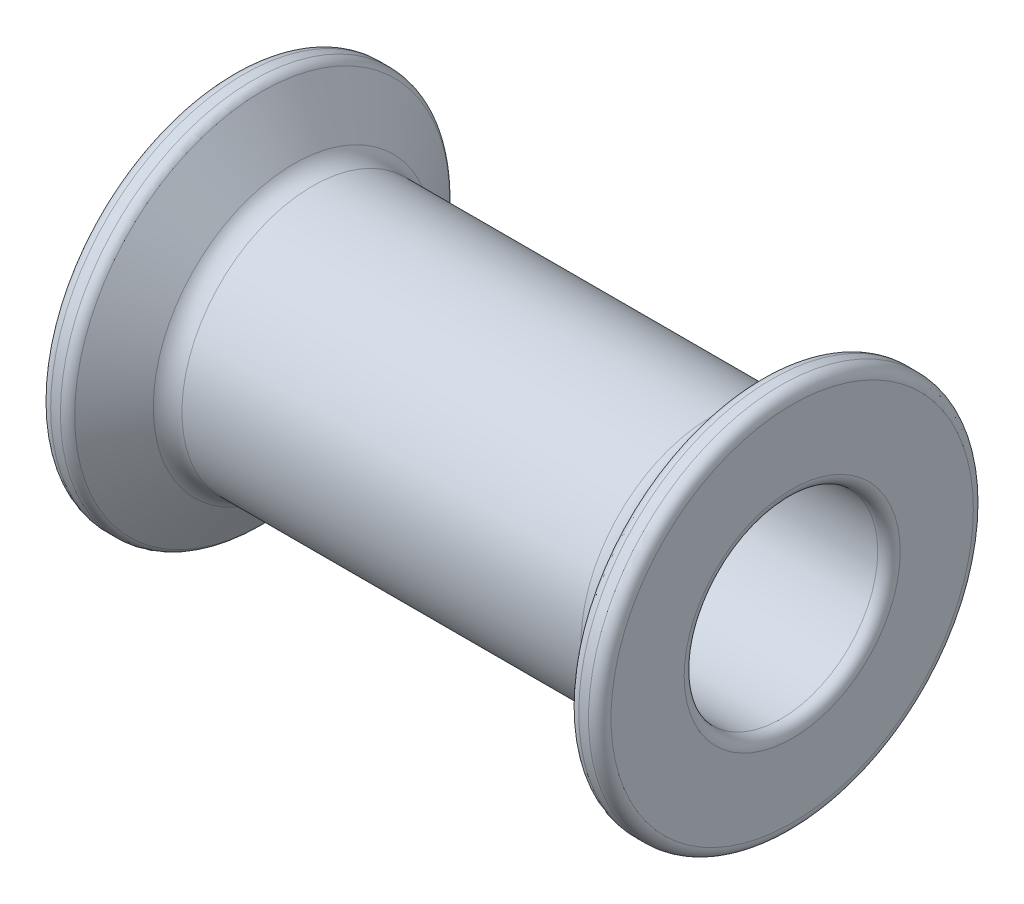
ISO-10303-21;
HEADER;
FILE_DESCRIPTION(('STEP AP214'),'2;1');
FILE_NAME('part.step','',(''),(''),'','','');
FILE_SCHEMA(('AUTOMOTIVE_DESIGN { 1 0 10303 214 1 1 1 1 }'));
ENDSEC;
DATA;
#1=APPLICATION_CONTEXT('core data for automotive mechanical design processes');
#2=APPLICATION_PROTOCOL_DEFINITION('international standard','automotive_design',2000,#1);
#3=PRODUCT_CONTEXT('',#1,'mechanical');
#4=PRODUCT('Part','Part','',(#3));
#5=PRODUCT_RELATED_PRODUCT_CATEGORY('part','',(#4));
#6=PRODUCT_DEFINITION_FORMATION('','',#4);
#7=PRODUCT_DEFINITION_CONTEXT('part definition',#1,'design');
#8=PRODUCT_DEFINITION('design','',#6,#7);
#9=PRODUCT_DEFINITION_SHAPE('','',#8);
#10=(LENGTH_UNIT() NAMED_UNIT(*) SI_UNIT(.MILLI.,.METRE.));
#11=(NAMED_UNIT(*) PLANE_ANGLE_UNIT() SI_UNIT($,.RADIAN.));
#12=(NAMED_UNIT(*) SI_UNIT($,.STERADIAN.) SOLID_ANGLE_UNIT());
#13=UNCERTAINTY_MEASURE_WITH_UNIT(LENGTH_MEASURE(1.E-05),#10,'distance_accuracy_value','');
#14=(GEOMETRIC_REPRESENTATION_CONTEXT(3) GLOBAL_UNCERTAINTY_ASSIGNED_CONTEXT((#13)) GLOBAL_UNIT_ASSIGNED_CONTEXT((#10,
#11,#12)) REPRESENTATION_CONTEXT('',''));
#15=CARTESIAN_POINT('',(0.,0.,0.));
#16=DIRECTION('',(0.,0.,1.));
#17=DIRECTION('',(1.,0.,0.));
#18=AXIS2_PLACEMENT_3D('',#15,#16,#17);
#19=CARTESIAN_POINT('',(0.,0.,0.));
#20=DIRECTION('',(1.,0.,0.));
#21=DIRECTION('',(0.,0.,-1.));
#22=AXIS2_PLACEMENT_3D('',#19,#20,#21);
#23=CYLINDRICAL_SURFACE('',#22,5.8);
#24=CARTESIAN_POINT('',(-8.86750447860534,0.,0.));
#25=DIRECTION('',(1.,0.,0.));
#26=DIRECTION('',(0.,0.,-1.));
#27=AXIS2_PLACEMENT_3D('',#24,#25,#26);
#28=CIRCLE('',#27,5.8);
#29=CARTESIAN_POINT('',(-8.86750447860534,0.,-5.8));
#30=VERTEX_POINT('',#29);
#31=EDGE_CURVE('E81',#30,#30,#28,.T.);
#32=ORIENTED_EDGE('',*,*,#31,.T.);
#33=EDGE_LOOP('',(#32));
#34=FACE_BOUND('',#33,.T.);
#35=CARTESIAN_POINT('',(8.86750447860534,0.,0.));
#36=DIRECTION('',(1.,0.,0.));
#37=DIRECTION('',(0.,0.,-1.));
#38=AXIS2_PLACEMENT_3D('',#35,#36,#37);
#39=CIRCLE('',#38,5.8);
#40=CARTESIAN_POINT('',(8.86750447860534,0.,-5.8));
#41=VERTEX_POINT('',#40);
#42=EDGE_CURVE('E84',#41,#41,#39,.F.);
#43=ORIENTED_EDGE('',*,*,#42,.T.);
#44=EDGE_LOOP('',(#43));
#45=FACE_BOUND('',#44,.T.);
#46=ADVANCED_FACE('F31',(#34,#45),#23,.T.);
#47=CARTESIAN_POINT('',(-9.4,0.,0.));
#48=DIRECTION('',(-1.,0.,0.));
#49=DIRECTION('',(0.,0.,1.));
#50=AXIS2_PLACEMENT_3D('',#47,#48,#49);
#51=CONICAL_SURFACE('',#50,5.8,0.978609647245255);
#52=CARTESIAN_POINT('',(-11.1013867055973,0.,0.));
#53=DIRECTION('',(1.,0.,0.));
#54=DIRECTION('',(0.,0.,-1.));
#55=AXIS2_PLACEMENT_3D('',#52,#53,#54);
#56=CIRCLE('',#55,8.32908834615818);
#57=CARTESIAN_POINT('',(-11.1013867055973,0.,-8.32908834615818));
#58=VERTEX_POINT('',#57);
#59=EDGE_CURVE('E42',#58,#58,#56,.T.);
#60=ORIENTED_EDGE('',*,*,#59,.T.);
#61=EDGE_LOOP('',(#60));
#62=FACE_BOUND('',#61,.T.);
#63=CARTESIAN_POINT('',(-9.69722658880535,0.,0.));
#64=DIRECTION('',(-1.,0.,0.));
#65=DIRECTION('',(0.,0.,1.));
#66=AXIS2_PLACEMENT_3D('',#63,#64,#65);
#67=CIRCLE('',#66,6.24182330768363);
#68=CARTESIAN_POINT('',(-9.69722658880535,0.,6.24182330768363));
#69=VERTEX_POINT('',#68);
#70=EDGE_CURVE('E78',#69,#69,#67,.T.);
#71=ORIENTED_EDGE('',*,*,#70,.T.);
#72=EDGE_LOOP('',(#71));
#73=FACE_BOUND('',#72,.T.);
#74=ADVANCED_FACE('F114',(#62,#73),#51,.T.);
#75=CARTESIAN_POINT('',(0.,0.,0.));
#76=DIRECTION('',(1.,0.,0.));
#77=DIRECTION('',(0.,0.,-1.));
#78=AXIS2_PLACEMENT_3D('',#75,#76,#77);
#79=CYLINDRICAL_SURFACE('',#78,8.55);
#80=CARTESIAN_POINT('',(-11.5162477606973,0.,0.));
#81=DIRECTION('',(-1.,0.,0.));
#82=DIRECTION('',(0.,0.,1.));
#83=AXIS2_PLACEMENT_3D('',#80,#81,#82);
#84=CIRCLE('',#83,8.55);
#85=CARTESIAN_POINT('',(-11.5162477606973,0.,8.55));
#86=VERTEX_POINT('',#85);
#87=EDGE_CURVE('E10',#86,#86,#84,.T.);
#88=ORIENTED_EDGE('',*,*,#87,.T.);
#89=EDGE_LOOP('',(#88));
#90=FACE_BOUND('',#89,.T.);
#91=CARTESIAN_POINT('',(-11.95,0.,0.));
#92=DIRECTION('',(-1.,0.,0.));
#93=DIRECTION('',(0.,0.,1.));
#94=AXIS2_PLACEMENT_3D('',#91,#92,#93);
#95=CIRCLE('',#94,8.55);
#96=CARTESIAN_POINT('',(-11.95,0.,8.55));
#97=VERTEX_POINT('',#96);
#98=EDGE_CURVE('E38',#97,#97,#95,.F.);
#99=ORIENTED_EDGE('',*,*,#98,.T.);
#100=EDGE_LOOP('',(#99));
#101=FACE_BOUND('',#100,.T.);
#102=ADVANCED_FACE('F120',(#90,#101),#79,.T.);
#103=CARTESIAN_POINT('',(-12.45,8.55,0.));
#104=DIRECTION('',(-1.,0.,0.));
#105=DIRECTION('',(0.,0.,1.));
#106=AXIS2_PLACEMENT_3D('',#103,#104,#105);
#107=PLANE('',#106);
#108=CARTESIAN_POINT('',(-12.45,0.,0.));
#109=DIRECTION('',(-1.,0.,0.));
#110=DIRECTION('',(0.,0.,1.));
#111=AXIS2_PLACEMENT_3D('',#108,#109,#110);
#112=CIRCLE('',#111,4.8);
#113=CARTESIAN_POINT('',(-12.45,0.,4.8));
#114=VERTEX_POINT('',#113);
#115=EDGE_CURVE('E69',#114,#114,#112,.F.);
#116=ORIENTED_EDGE('',*,*,#115,.T.);
#117=EDGE_LOOP('',(#116));
#118=FACE_BOUND('',#117,.T.);
#119=CARTESIAN_POINT('',(-12.45,0.,0.));
#120=DIRECTION('',(-1.,0.,0.));
#121=DIRECTION('',(0.,0.,1.));
#122=AXIS2_PLACEMENT_3D('',#119,#120,#121);
#123=CIRCLE('',#122,8.05);
#124=CARTESIAN_POINT('',(-12.45,0.,8.05));
#125=VERTEX_POINT('',#124);
#126=EDGE_CURVE('E72',#125,#125,#123,.T.);
#127=ORIENTED_EDGE('',*,*,#126,.T.);
#128=EDGE_LOOP('',(#127));
#129=FACE_BOUND('',#128,.T.);
#130=ADVANCED_FACE('F110',(#118,#129),#107,.T.);
#131=CARTESIAN_POINT('',(0.,0.,0.));
#132=DIRECTION('',(1.,0.,0.));
#133=DIRECTION('',(0.,0.,-1.));
#134=AXIS2_PLACEMENT_3D('',#131,#132,#133);
#135=CYLINDRICAL_SURFACE('',#134,4.3);
#136=CARTESIAN_POINT('',(-11.95,0.,0.));
#137=DIRECTION('',(-1.,0.,0.));
#138=DIRECTION('',(0.,0.,1.));
#139=AXIS2_PLACEMENT_3D('',#136,#137,#138);
#140=CIRCLE('',#139,4.3);
#141=CARTESIAN_POINT('',(-11.95,0.,4.3));
#142=VERTEX_POINT('',#141);
#143=EDGE_CURVE('E63',#142,#142,#140,.T.);
#144=ORIENTED_EDGE('',*,*,#143,.T.);
#145=EDGE_LOOP('',(#144));
#146=FACE_BOUND('',#145,.T.);
#147=CARTESIAN_POINT('',(11.95,0.,0.));
#148=DIRECTION('',(1.,0.,0.));
#149=DIRECTION('',(0.,0.,-1.));
#150=AXIS2_PLACEMENT_3D('',#147,#148,#149);
#151=CIRCLE('',#150,4.3);
#152=CARTESIAN_POINT('',(11.95,0.,-4.3));
#153=VERTEX_POINT('',#152);
#154=EDGE_CURVE('E66',#153,#153,#151,.T.);
#155=ORIENTED_EDGE('',*,*,#154,.T.);
#156=EDGE_LOOP('',(#155));
#157=FACE_BOUND('',#156,.T.);
#158=ADVANCED_FACE('F100',(#146,#157),#135,.F.);
#159=CARTESIAN_POINT('',(9.4,0.,0.));
#160=DIRECTION('',(1.,0.,0.));
#161=DIRECTION('',(0.,0.,1.));
#162=AXIS2_PLACEMENT_3D('',#159,#160,#161);
#163=CONICAL_SURFACE('',#162,5.8,0.978609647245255);
#164=CARTESIAN_POINT('',(11.1013867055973,0.,0.));
#165=DIRECTION('',(-1.,0.,0.));
#166=DIRECTION('',(0.,0.,1.));
#167=AXIS2_PLACEMENT_3D('',#164,#165,#166);
#168=CIRCLE('',#167,8.32908834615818);
#169=CARTESIAN_POINT('',(11.1013867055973,0.,8.32908834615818));
#170=VERTEX_POINT('',#169);
#171=EDGE_CURVE('E46',#170,#170,#168,.T.);
#172=ORIENTED_EDGE('',*,*,#171,.T.);
#173=EDGE_LOOP('',(#172));
#174=FACE_BOUND('',#173,.T.);
#175=CARTESIAN_POINT('',(9.69722658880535,0.,0.));
#176=DIRECTION('',(1.,0.,0.));
#177=DIRECTION('',(0.,0.,-1.));
#178=AXIS2_PLACEMENT_3D('',#175,#176,#177);
#179=CIRCLE('',#178,6.24182330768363);
#180=CARTESIAN_POINT('',(9.69722658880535,0.,-6.24182330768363));
#181=VERTEX_POINT('',#180);
#182=EDGE_CURVE('E75',#181,#181,#179,.T.);
#183=ORIENTED_EDGE('',*,*,#182,.T.);
#184=EDGE_LOOP('',(#183));
#185=FACE_BOUND('',#184,.T.);
#186=ADVANCED_FACE('F97',(#174,#185),#163,.T.);
#187=CARTESIAN_POINT('',(0.,0.,0.));
#188=DIRECTION('',(-1.,0.,0.));
#189=DIRECTION('',(0.,0.,-1.));
#190=AXIS2_PLACEMENT_3D('',#187,#188,#189);
#191=CYLINDRICAL_SURFACE('',#190,8.55);
#192=CARTESIAN_POINT('',(11.95,0.,0.));
#193=DIRECTION('',(1.,0.,0.));
#194=DIRECTION('',(0.,0.,-1.));
#195=AXIS2_PLACEMENT_3D('',#192,#193,#194);
#196=CIRCLE('',#195,8.55);
#197=CARTESIAN_POINT('',(11.95,0.,-8.55));
#198=VERTEX_POINT('',#197);
#199=EDGE_CURVE('E51',#198,#198,#196,.F.);
#200=ORIENTED_EDGE('',*,*,#199,.T.);
#201=EDGE_LOOP('',(#200));
#202=FACE_BOUND('',#201,.T.);
#203=CARTESIAN_POINT('',(11.5162477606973,0.,0.));
#204=DIRECTION('',(-1.,0.,0.));
#205=DIRECTION('',(0.,0.,1.));
#206=AXIS2_PLACEMENT_3D('',#203,#204,#205);
#207=CIRCLE('',#206,8.55);
#208=CARTESIAN_POINT('',(11.5162477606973,0.,8.55));
#209=VERTEX_POINT('',#208);
#210=EDGE_CURVE('E54',#209,#209,#207,.F.);
#211=ORIENTED_EDGE('',*,*,#210,.T.);
#212=EDGE_LOOP('',(#211));
#213=FACE_BOUND('',#212,.T.);
#214=ADVANCED_FACE('F99',(#202,#213),#191,.T.);
#215=CARTESIAN_POINT('',(12.45,8.55,0.));
#216=DIRECTION('',(1.,0.,0.));
#217=DIRECTION('',(0.,0.,1.));
#218=AXIS2_PLACEMENT_3D('',#215,#216,#217);
#219=PLANE('',#218);
#220=CARTESIAN_POINT('',(12.45,0.,0.));
#221=DIRECTION('',(1.,0.,0.));
#222=DIRECTION('',(0.,0.,-1.));
#223=AXIS2_PLACEMENT_3D('',#220,#221,#222);
#224=CIRCLE('',#223,4.8);
#225=CARTESIAN_POINT('',(12.45,0.,-4.8));
#226=VERTEX_POINT('',#225);
#227=EDGE_CURVE('E57',#226,#226,#224,.F.);
#228=ORIENTED_EDGE('',*,*,#227,.T.);
#229=EDGE_LOOP('',(#228));
#230=FACE_BOUND('',#229,.T.);
#231=CARTESIAN_POINT('',(12.45,0.,0.));
#232=DIRECTION('',(1.,0.,0.));
#233=DIRECTION('',(0.,0.,-1.));
#234=AXIS2_PLACEMENT_3D('',#231,#232,#233);
#235=CIRCLE('',#234,8.05);
#236=CARTESIAN_POINT('',(12.45,0.,-8.05));
#237=VERTEX_POINT('',#236);
#238=EDGE_CURVE('E60',#237,#237,#235,.T.);
#239=ORIENTED_EDGE('',*,*,#238,.T.);
#240=EDGE_LOOP('',(#239));
#241=FACE_BOUND('',#240,.T.);
#242=ADVANCED_FACE('F107',(#230,#241),#219,.T.);
#243=CARTESIAN_POINT('',(-8.86750447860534,0.,0.));
#244=DIRECTION('',(1.,0.,0.));
#245=DIRECTION('',(0.,0.,-1.));
#246=AXIS2_PLACEMENT_3D('',#243,#244,#245);
#247=TOROIDAL_SURFACE('',#246,6.8,1.);
#248=ORIENTED_EDGE('',*,*,#70,.F.);
#249=EDGE_LOOP('',(#248));
#250=FACE_BOUND('',#249,.T.);
#251=ORIENTED_EDGE('',*,*,#31,.F.);
#252=EDGE_LOOP('',(#251));
#253=FACE_BOUND('',#252,.T.);
#254=ADVANCED_FACE('F93',(#250,#253),#247,.F.);
#255=CARTESIAN_POINT('',(8.86750447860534,0.,0.));
#256=DIRECTION('',(1.,0.,0.));
#257=DIRECTION('',(0.,0.,-1.));
#258=AXIS2_PLACEMENT_3D('',#255,#256,#257);
#259=TOROIDAL_SURFACE('',#258,6.8,1.);
#260=ORIENTED_EDGE('',*,*,#42,.F.);
#261=EDGE_LOOP('',(#260));
#262=FACE_BOUND('',#261,.T.);
#263=ORIENTED_EDGE('',*,*,#182,.F.);
#264=EDGE_LOOP('',(#263));
#265=FACE_BOUND('',#264,.T.);
#266=ADVANCED_FACE('F89',(#262,#265),#259,.F.);
#267=CARTESIAN_POINT('',(-11.95,0.,0.));
#268=DIRECTION('',(-1.,0.,0.));
#269=DIRECTION('',(0.,0.,1.));
#270=AXIS2_PLACEMENT_3D('',#267,#268,#269);
#271=TOROIDAL_SURFACE('',#270,4.8,0.5);
#272=ORIENTED_EDGE('',*,*,#143,.F.);
#273=EDGE_LOOP('',(#272));
#274=FACE_BOUND('',#273,.T.);
#275=ORIENTED_EDGE('',*,*,#115,.F.);
#276=EDGE_LOOP('',(#275));
#277=FACE_BOUND('',#276,.T.);
#278=ADVANCED_FACE('F92',(#274,#277),#271,.T.);
#279=CARTESIAN_POINT('',(11.95,0.,0.));
#280=DIRECTION('',(1.,0.,0.));
#281=DIRECTION('',(0.,0.,-1.));
#282=AXIS2_PLACEMENT_3D('',#279,#280,#281);
#283=TOROIDAL_SURFACE('',#282,4.8,0.5);
#284=ORIENTED_EDGE('',*,*,#227,.F.);
#285=EDGE_LOOP('',(#284));
#286=FACE_BOUND('',#285,.T.);
#287=ORIENTED_EDGE('',*,*,#154,.F.);
#288=EDGE_LOOP('',(#287));
#289=FACE_BOUND('',#288,.T.);
#290=ADVANCED_FACE('F130',(#286,#289),#283,.T.);
#291=CARTESIAN_POINT('',(11.95,0.,0.));
#292=DIRECTION('',(1.,0.,0.));
#293=DIRECTION('',(0.,0.,-1.));
#294=AXIS2_PLACEMENT_3D('',#291,#292,#293);
#295=TOROIDAL_SURFACE('',#294,8.05,0.5);
#296=ORIENTED_EDGE('',*,*,#199,.F.);
#297=EDGE_LOOP('',(#296));
#298=FACE_BOUND('',#297,.T.);
#299=ORIENTED_EDGE('',*,*,#238,.F.);
#300=EDGE_LOOP('',(#299));
#301=FACE_BOUND('',#300,.T.);
#302=ADVANCED_FACE('F134',(#298,#301),#295,.T.);
#303=CARTESIAN_POINT('',(11.5162477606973,0.,0.));
#304=DIRECTION('',(-1.,0.,0.));
#305=DIRECTION('',(0.,0.,1.));
#306=AXIS2_PLACEMENT_3D('',#303,#304,#305);
#307=TOROIDAL_SURFACE('',#306,8.05,0.5);
#308=ORIENTED_EDGE('',*,*,#171,.F.);
#309=EDGE_LOOP('',(#308));
#310=FACE_BOUND('',#309,.T.);
#311=ORIENTED_EDGE('',*,*,#210,.F.);
#312=EDGE_LOOP('',(#311));
#313=FACE_BOUND('',#312,.T.);
#314=ADVANCED_FACE('F138',(#310,#313),#307,.T.);
#315=CARTESIAN_POINT('',(-11.5162477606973,0.,0.));
#316=DIRECTION('',(-1.,0.,0.));
#317=DIRECTION('',(0.,0.,1.));
#318=AXIS2_PLACEMENT_3D('',#315,#316,#317);
#319=TOROIDAL_SURFACE('',#318,8.05,0.5);
#320=ORIENTED_EDGE('',*,*,#87,.F.);
#321=EDGE_LOOP('',(#320));
#322=FACE_BOUND('',#321,.T.);
#323=ORIENTED_EDGE('',*,*,#59,.F.);
#324=EDGE_LOOP('',(#323));
#325=FACE_BOUND('',#324,.T.);
#326=ADVANCED_FACE('F141',(#322,#325),#319,.T.);
#327=CARTESIAN_POINT('',(-11.95,0.,0.));
#328=DIRECTION('',(-1.,0.,0.));
#329=DIRECTION('',(0.,0.,1.));
#330=AXIS2_PLACEMENT_3D('',#327,#328,#329);
#331=TOROIDAL_SURFACE('',#330,8.05,0.5);
#332=ORIENTED_EDGE('',*,*,#126,.F.);
#333=EDGE_LOOP('',(#332));
#334=FACE_BOUND('',#333,.T.);
#335=ORIENTED_EDGE('',*,*,#98,.F.);
#336=EDGE_LOOP('',(#335));
#337=FACE_BOUND('',#336,.T.);
#338=ADVANCED_FACE('F33',(#334,#337),#331,.T.);
#339=CLOSED_SHELL('',(#46,#74,#102,#130,#158,#186,#214,#242,#254,#266,#278,#290,#302,#314,#326,#338));
#340=MANIFOLD_SOLID_BREP('B2',#339);
#341=ADVANCED_BREP_SHAPE_REPRESENTATION('',(#18,#340),#14);
#342=SHAPE_DEFINITION_REPRESENTATION(#9,#341);
ENDSEC;
END-ISO-10303-21;
